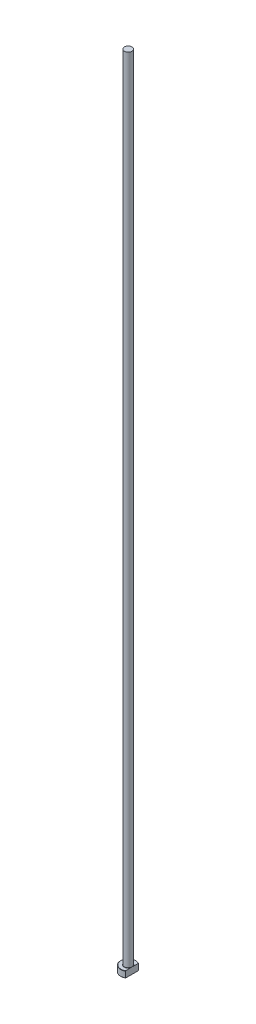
from build123d import *
from build123d.topology import SkipClean

# Parameters (mm, degrees)
CHAMFER1_SIZE = 0.2
FILLET1_R     = 0.2
KEY_DEPTH     = 631.057140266


with BuildPart() as part:
    # Sketch1 → Revolve1 (revolve)
    with BuildSketch(Plane.XY, mode=Mode.PRIVATE) as revolve1_sk:
        Polygon((0, 0), (-6, 0), (-6, 5), (-3, 5), (-3, 630), (0, 630), align=None)
    revolve(revolve1_sk.sketch.rotate(Axis((0, 259.958771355, 0), (0, -1, 0)), 270), axis=Axis((0, 259.958771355, 0), (0, -1, 0)))

    # Chamfer1
    chamfer1_edges = [part.edges().sort_by_distance(p)[0] for p in [
        (0, 5, -6),
        (0, 0, -6),
    ]]
    chamfer(chamfer1_edges, length=CHAMFER1_SIZE)

    # Fillet1
    fillet1_edges = [part.edges().sort_by_distance(p)[0] for p in [
        (0, 5, -3),
    ]]
    fillet(fillet1_edges, radius=FILLET1_R)

    # Sketch2 → KEY (cut, through all)
    with SkipClean():  # the faces are left unmerged after this step: merging them gives an invalid solid
        with BuildSketch(Plane(origin=(0, 0, 0), x_dir=(1, 0, 0), z_dir=(0, 1, 0))):
            with BuildLine():
                Line((3, 5.196152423), (3, -5.196152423))
                ThreePointArc((3, -5.196152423), (6, 0), (3, 5.196152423))
            make_face()
        extrude(amount=KEY_DEPTH, mode=Mode.SUBTRACT)


solid = part.part
